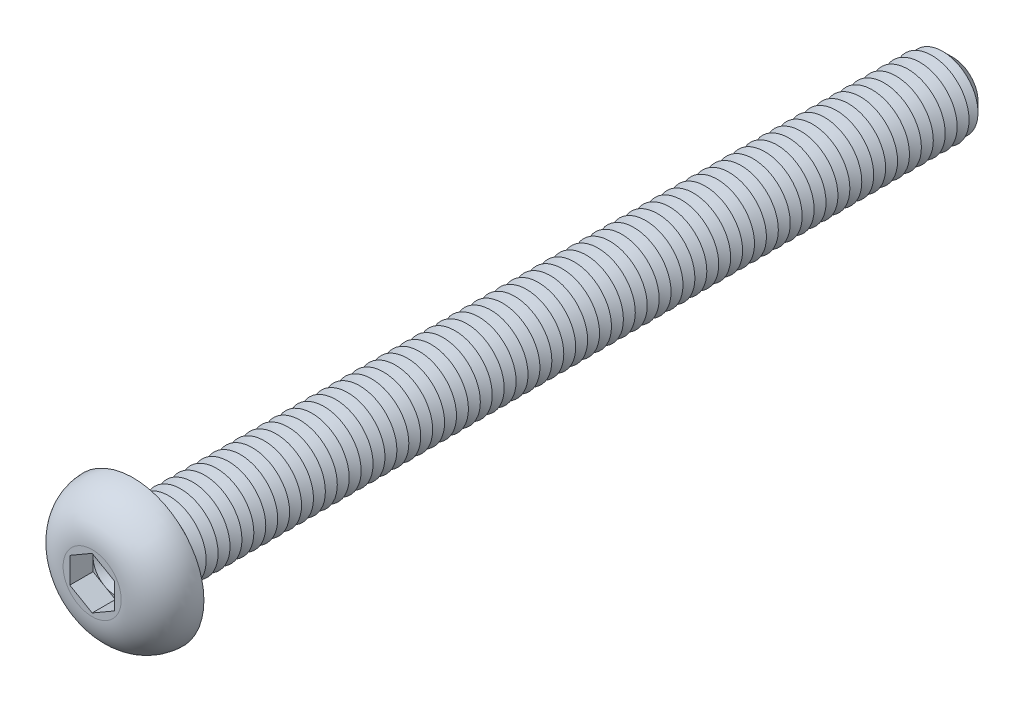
from build123d import *

# Parameters (mm, degrees)
CUT_EXTRUDE1_DEPTH  = 1.56
SKETCH4_R           = 2.5
BOSS_EXTRUDE1_DEPTH = 55
CHAMFER1_SIZE       = 0.8
LPATTERN1_COUNT     = 67
LPATTERN1_PITCH     = 0.8
FILLET2_R           = 0.4


with BuildPart() as part:
    # Sketch2 → Revolve1 (revolve)
    with BuildSketch(Plane(origin=(0, 0, 0), x_dir=(0, 0, -1), z_dir=(1, 0, 0)), mode=Mode.PRIVATE) as revolve1_sk:
        with BuildLine():
            Line((0, 0), (-2.75, 0))
            Line((-2.75, 0), (-2.75, 1.950446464))
            ThreePointArc((-2.75, 1.950446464), (-1.947498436, 3.912588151), (0, 4.75))
            Line((0, 4.75), (0, 0))
        make_face()
    revolve(revolve1_sk.sketch.rotate(Axis((0, 0, 47.934239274), (0, 0, -1)), 90), axis=Axis((0, 0, 47.934239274), (0, 0, -1)))

    # Sketch3 → Cut-Extrude1 (cut)
    with BuildSketch(Plane.XY.offset(2.75)):
        Polygon((0, 1.732050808), (-1.5, 0.866025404), (-1.5, -0.866025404), (0, -1.732050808), (1.5, -0.866025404), (1.5, 0.866025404), align=None)
    extrude(amount=-CUT_EXTRUDE1_DEPTH, mode=Mode.SUBTRACT)

    # Sketch4 → Boss-Extrude1 (add)
    with BuildSketch(Plane(origin=(0, 0, 0), x_dir=(-1, 0, 0), z_dir=(0, 0, -1))):
        with Locations(Location((0, 0, 0), (0, 0, 180))):
            Circle(SKETCH4_R)
    extrude(amount=BOSS_EXTRUDE1_DEPTH)

    # Chamfer1
    chamfer1_edges = [part.edges().sort_by_distance(p)[0] for p in [
        (-2.5, 0, -55),
    ]]
    chamfer(chamfer1_edges, length=CHAMFER1_SIZE)

    # Sketch5 → Cut-Revolve1 (revolve, cut)
    with BuildSketch(Plane(origin=(0, 0, 0), x_dir=(0, 0, -1), z_dir=(1, 0, 0)), mode=Mode.PRIVATE) as cut_revolve1_sk:
        Polygon((0.8, 2.5), (1.6, 2.5), (1.2, 1.807179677), align=None)
    cut_revolve1 = revolve(cut_revolve1_sk.sketch.rotate(Axis((0, 0, 47.934239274), (0, 0, -1)), 90), axis=Axis((0, 0, 47.934239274), (0, 0, -1)), mode=Mode.SUBTRACT)

    # LPattern1: Cut-Revolve1 ×67
    with Locations(*[(0, 0, -i * LPATTERN1_PITCH) for i in range(1, LPATTERN1_COUNT)]):
        add(cut_revolve1, mode=Mode.SUBTRACT)

    # Fillet2
    fillet2_edges = [part.edges().sort_by_distance(p)[0] for p in [
        (-2.5, 0, 0),
    ]]
    fillet(fillet2_edges, radius=FILLET2_R)

    # Cut-Extrude2 cone 1 section (on through the dimple's axis) → Cut-Extrude2 (revolve, cut)
    with BuildSketch(Plane(origin=(0, 0, 1.19), x_dir=(0, -1, 0), z_dir=(1, 0, 0))):
        Polygon((0, 0), (1.5, 0), (0, 0.866025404), align=None)
    revolve(axis=Axis((0, 0, 1.19), (0, 0, -1)), mode=Mode.SUBTRACT)


solid = part.part
